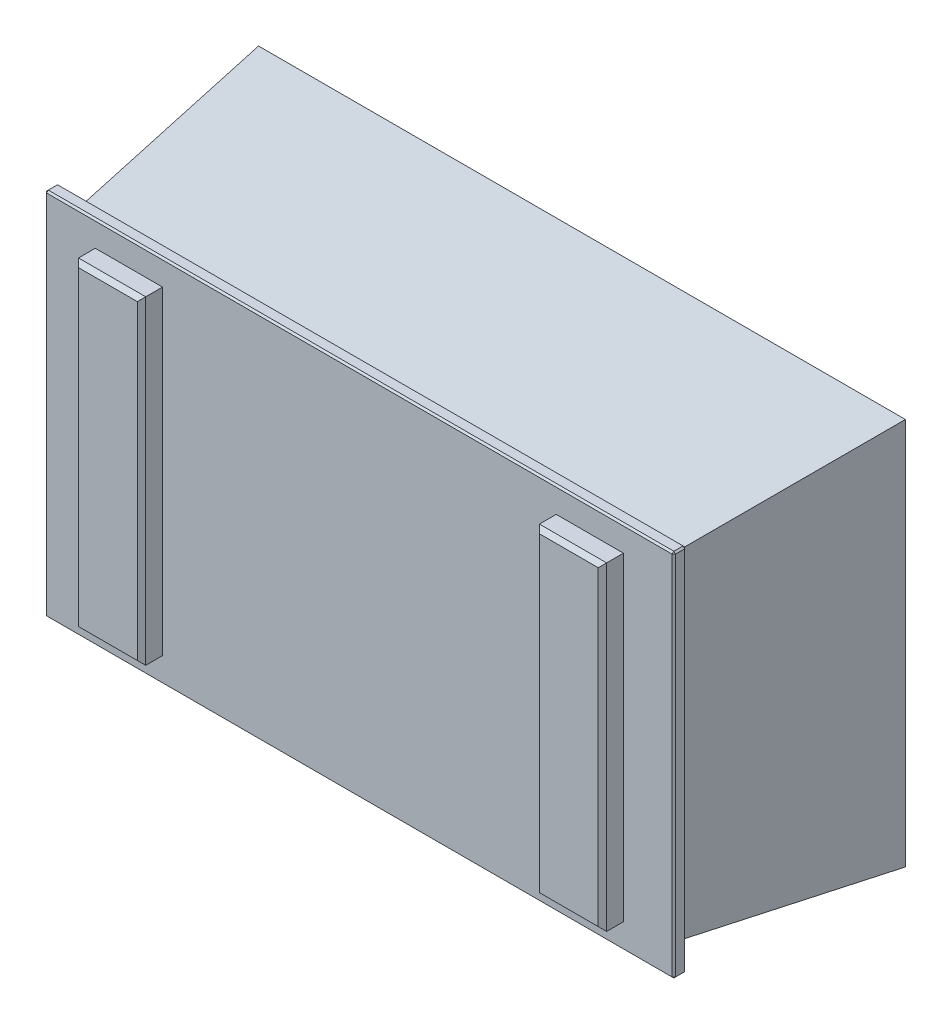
from build123d import *

# Parameters (mm, degrees)
ESQUISSE1_W             = 748.736409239
ESQUISSE1_H             = 440
BOSS_EXTRU_1_DEPTH      = 15
ESQUISSE2_W             = 708.736409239
ESQUISSE2_H             = 400
ESQUISSE2_W_2           = 668.736409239
ESQUISSE2_H_2           = 360
BOSS_EXTRU_2_DEPTH      = 250
BOSS_EXTRU_2_DRAFT      = -7
ESQUISSE3_W             = 668.736409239
ESQUISSE3_H             = 360
ENL_V_MAT_EXTRU_1_DEPTH = 250
ENL_V_MAT_EXTRU_1_DRAFT = -7
ESQUISSE4_W             = 80
ESQUISSE4_H             = 380
BOSS_EXTRU_3_DEPTH      = 25
CHANFREIN1_SIZE         = 5
CHANFREIN2_SIZE         = 2


with BuildPart() as part:
    # Esquisse1 → Boss.-Extru.1 (new body)
    with BuildSketch(Plane.XY.offset(-44.900175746)):
        with Locations((-126.849384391, 0)):
            Rectangle(ESQUISSE1_W, ESQUISSE1_H)
    extrude(amount=BOSS_EXTRU_1_DEPTH)


with BuildPart() as boss_extru_2_tool:
    # Esquisse2 → Boss.-Extru.2 (with draft: the straight prism first)
    with BuildSketch(Plane(origin=(0, 0, -44.900175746), x_dir=(-1, 0, 0), z_dir=(0, 0, -1))):
        with Locations((126.849384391, 0)):
            Rectangle(ESQUISSE2_W, ESQUISSE2_H)
        with Locations((126.849384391, 0)):
            Rectangle(ESQUISSE2_W_2, ESQUISSE2_H_2, mode=Mode.SUBTRACT)
    extrude(amount=BOSS_EXTRU_2_DEPTH)
    # Boss.-Extru.2: the draft: its side faces are tilted about the plane it starts from
    boss_extru_2_sides = [boss_extru_2_tool.faces().sort_by_distance(p)[0] for p in [
        (-481.21758901, 0, -169.900175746),
        (-126.849384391, 200, -169.900175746),
        (227.518820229, 0, -169.900175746),
        (-126.849384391, -200, -169.900175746),
        (-126.849384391, -180, -169.900175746),
        (207.518820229, 0, -169.900175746),
        (-126.849384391, 180, -169.900175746),
        (-461.21758901, 0, -169.900175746),
    ]]
    draft(boss_extru_2_sides, Plane(origin=(0, 0, -44.900175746), x_dir=(-1, 0, 0), z_dir=(0, 0, -1)), BOSS_EXTRU_2_DRAFT)


with BuildPart() as part_1:
    add(part.part)

    # Boss.-Extru.2: add boss_extru_2_tool
    add(boss_extru_2_tool.part)


with BuildPart() as enl_v_mat_extru_1_tool:
    # Esquisse3 → Enl_v. mat.-Extru.1 (with draft: the straight prism first)
    with BuildSketch(Plane(origin=(0, 0, -44.900175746), x_dir=(-1, 0, 0), z_dir=(0, 0, -1))):
        with Locations((126.849384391, 0)):
            Rectangle(ESQUISSE3_W, ESQUISSE3_H)
    extrude(amount=ENL_V_MAT_EXTRU_1_DEPTH)
    # Enl_v. mat.-Extru.1: the draft: its side faces are tilted about the plane it starts from
    enl_v_mat_extru_1_sides = [enl_v_mat_extru_1_tool.faces().sort_by_distance(p)[0] for p in [
        (-126.849384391, 180, -169.900175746),
        (207.518820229, 0, -169.900175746),
        (-126.849384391, -180, -169.900175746),
        (-461.21758901, 0, -169.900175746),
    ]]
    draft(enl_v_mat_extru_1_sides, Plane(origin=(0, 0, -44.900175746), x_dir=(-1, 0, 0), z_dir=(0, 0, -1)), ENL_V_MAT_EXTRU_1_DRAFT)


with BuildPart() as part_2:
    add(part_1.part)

    # Enl_v. mat.-Extru.1: cut by enl_v_mat_extru_1_tool
    add(enl_v_mat_extru_1_tool.part, mode=Mode.SUBTRACT)

    # Esquisse4 → Boss.-Extru.3 (add)
    with BuildSketch(Plane.XY.offset(-29.900175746)):
        with Locations((147.518820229, 0)):
            Rectangle(ESQUISSE4_W, ESQUISSE4_H)
        with Locations((-401.21758901, 0)):
            Rectangle(ESQUISSE4_W, ESQUISSE4_H)
    extrude(amount=BOSS_EXTRU_3_DEPTH)

    # Chanfrein1
    chanfrein1_edges = [part_2.edges().sort_by_distance(p)[0] for p in [
        (187.518820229, 0, -4.900175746),
        (147.518820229, 190, -4.900175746),
        (107.518820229, 0, -4.900175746),
        (147.518820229, -190, -4.900175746),
        (-361.21758901, 0, -4.900175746),
        (-401.21758901, 190, -4.900175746),
        (-441.21758901, 0, -4.900175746),
        (-401.21758901, -190, -4.900175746),
    ]]
    chamfer(chanfrein1_edges, length=CHANFREIN1_SIZE)

    # Chanfrein2
    chanfrein2_edges = [part_2.edges().sort_by_distance(p)[0] for p in [
        (247.518820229, 0, -29.900175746),
        (-126.849384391, 220, -29.900175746),
        (-501.21758901, 0, -29.900175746),
        (-126.849384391, 220, -44.900175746),
        (247.518820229, 0, -44.900175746),
        (-126.849384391, -220, -44.900175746),
        (-501.21758901, 0, -44.900175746),
        (-126.849384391, -220, -29.900175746),
        (-501.21758901, 220, -37.400175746),
        (247.518820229, 220, -37.400175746),
        (247.518820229, -220, -37.400175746),
        (-501.21758901, -220, -37.400175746),
    ]]
    chamfer(chanfrein2_edges, length=CHANFREIN2_SIZE)


solid = part_2.part
